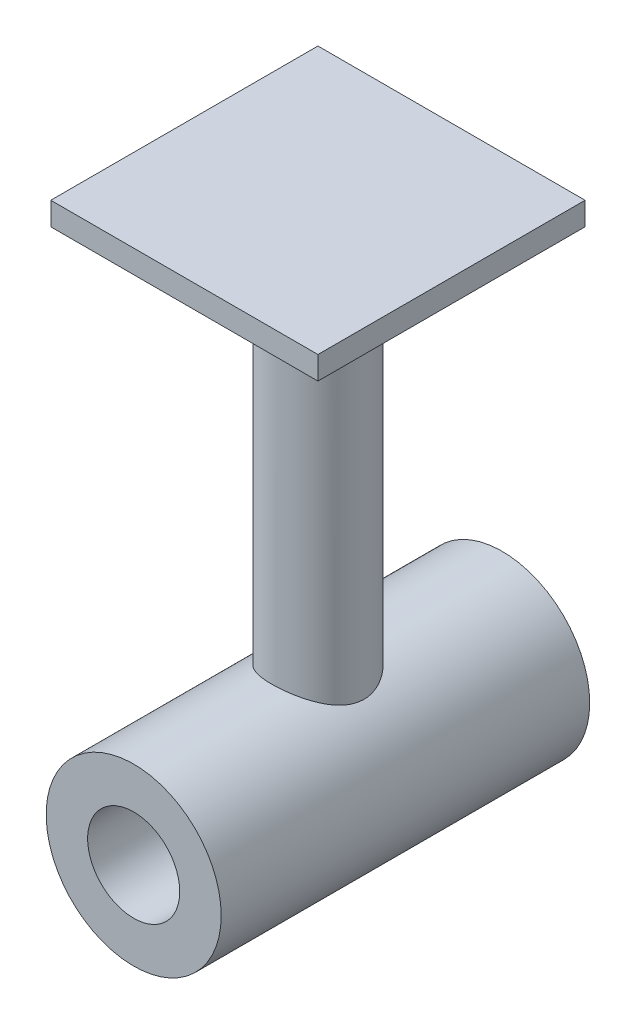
ISO-10303-21;
HEADER;
FILE_DESCRIPTION(('STEP AP214'),'2;1');
FILE_NAME('part.step','',(''),(''),'','','');
FILE_SCHEMA(('AUTOMOTIVE_DESIGN { 1 0 10303 214 1 1 1 1 }'));
ENDSEC;
DATA;
#1=APPLICATION_CONTEXT('core data for automotive mechanical design processes');
#2=APPLICATION_PROTOCOL_DEFINITION('international standard','automotive_design',2000,#1);
#3=PRODUCT_CONTEXT('',#1,'mechanical');
#4=PRODUCT('Part','Part','',(#3));
#5=PRODUCT_RELATED_PRODUCT_CATEGORY('part','',(#4));
#6=PRODUCT_DEFINITION_FORMATION('','',#4);
#7=PRODUCT_DEFINITION_CONTEXT('part definition',#1,'design');
#8=PRODUCT_DEFINITION('design','',#6,#7);
#9=PRODUCT_DEFINITION_SHAPE('','',#8);
#10=(LENGTH_UNIT() NAMED_UNIT(*) SI_UNIT(.MILLI.,.METRE.));
#11=(NAMED_UNIT(*) PLANE_ANGLE_UNIT() SI_UNIT($,.RADIAN.));
#12=(NAMED_UNIT(*) SI_UNIT($,.STERADIAN.) SOLID_ANGLE_UNIT());
#13=UNCERTAINTY_MEASURE_WITH_UNIT(LENGTH_MEASURE(1.E-05),#10,'distance_accuracy_value','');
#14=(GEOMETRIC_REPRESENTATION_CONTEXT(3) GLOBAL_UNCERTAINTY_ASSIGNED_CONTEXT((#13)) GLOBAL_UNIT_ASSIGNED_CONTEXT((#10,
#11,#12)) REPRESENTATION_CONTEXT('',''));
#15=CARTESIAN_POINT('',(0.,0.,0.));
#16=DIRECTION('',(0.,0.,1.));
#17=DIRECTION('',(1.,0.,0.));
#18=AXIS2_PLACEMENT_3D('',#15,#16,#17);
#19=CARTESIAN_POINT('',(0.,0.,40.));
#20=DIRECTION('',(0.,0.,-1.));
#21=DIRECTION('',(-1.,0.,0.));
#22=AXIS2_PLACEMENT_3D('',#19,#20,#21);
#23=CYLINDRICAL_SURFACE('',#22,19.);
#24=CARTESIAN_POINT('',(0.,0.,-40.));
#25=DIRECTION('',(0.,0.,1.));
#26=DIRECTION('',(1.,0.,0.));
#27=AXIS2_PLACEMENT_3D('',#24,#25,#26);
#28=CIRCLE('',#27,19.);
#29=CARTESIAN_POINT('',(19.,0.,-40.));
#30=VERTEX_POINT('',#29);
#31=EDGE_CURVE('E162',#30,#30,#28,.T.);
#32=ORIENTED_EDGE('',*,*,#31,.T.);
#33=EDGE_LOOP('',(#32));
#34=FACE_BOUND('',#33,.T.);
#35=CARTESIAN_POINT('',(0.,0.,40.));
#36=DIRECTION('',(0.,0.,1.));
#37=DIRECTION('',(1.,0.,0.));
#38=AXIS2_PLACEMENT_3D('',#35,#36,#37);
#39=CIRCLE('',#38,19.);
#40=CARTESIAN_POINT('',(19.,0.,40.));
#41=VERTEX_POINT('',#40);
#42=EDGE_CURVE('E165',#41,#41,#39,.T.);
#43=ORIENTED_EDGE('',*,*,#42,.F.);
#44=EDGE_LOOP('',(#43));
#45=FACE_BOUND('',#44,.T.);
#46=CARTESIAN_POINT('',(0.,19.,-10.));
#47=CARTESIAN_POINT('',(-0.261284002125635,19.0000005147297,-10.0000006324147));
#48=CARTESIAN_POINT('',(-0.522560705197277,18.9945987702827,-9.9897489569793));
#49=CARTESIAN_POINT('',(-1.04316816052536,18.9731308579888,-9.94886917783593));
#50=CARTESIAN_POINT('',(-1.30249817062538,18.957060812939,-9.91823366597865));
#51=CARTESIAN_POINT('',(-1.81751271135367,18.9146374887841,-9.8369057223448));
#52=CARTESIAN_POINT('',(-2.07319149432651,18.8882695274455,-9.78618465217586));
#53=CARTESIAN_POINT('',(-2.57867692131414,18.8259203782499,-9.66529653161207));
#54=CARTESIAN_POINT('',(-2.82848403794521,18.7899399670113,-9.59513105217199));
#55=CARTESIAN_POINT('',(-3.31961543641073,18.7094050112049,-9.43644465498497));
#56=CARTESIAN_POINT('',(-3.56096999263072,18.6648858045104,-9.34799927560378));
#57=CARTESIAN_POINT('',(-4.03485602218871,18.5682100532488,-9.15344464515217));
#58=CARTESIAN_POINT('',(-4.26738734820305,18.5160533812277,-9.04733509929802));
#59=CARTESIAN_POINT('',(-4.72235633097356,18.4052752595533,-8.81840050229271));
#60=CARTESIAN_POINT('',(-4.94479706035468,18.3466557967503,-8.69558058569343));
#61=CARTESIAN_POINT('',(-5.37873126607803,18.2241626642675,-8.43406514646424));
#62=CARTESIAN_POINT('',(-5.59022036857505,18.1602869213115,-8.29536335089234));
#63=CARTESIAN_POINT('',(-6.01460634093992,18.024353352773,-7.99353665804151));
#64=CARTESIAN_POINT('',(-6.22670849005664,17.9520335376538,-7.82941208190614));
#65=CARTESIAN_POINT('',(-6.63651342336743,17.804609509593,-7.48520583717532));
#66=CARTESIAN_POINT('',(-6.83421528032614,17.7295051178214,-7.305123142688));
#67=CARTESIAN_POINT('',(-7.21451054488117,17.5781895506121,-6.92980933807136));
#68=CARTESIAN_POINT('',(-7.39709330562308,17.5019776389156,-6.73456773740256));
#69=CARTESIAN_POINT('',(-7.74621354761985,17.3502856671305,-6.32989771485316));
#70=CARTESIAN_POINT('',(-7.91274787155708,17.2748057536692,-6.12046651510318));
#71=CARTESIAN_POINT('',(-8.24291049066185,17.1198877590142,-5.66915875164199));
#72=CARTESIAN_POINT('',(-8.40497498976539,17.0406912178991,-5.42605141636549));
#73=CARTESIAN_POINT('',(-8.70782467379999,16.8879410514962,-4.92537784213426));
#74=CARTESIAN_POINT('',(-8.84861889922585,16.8143850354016,-4.6678178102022));
#75=CARTESIAN_POINT('',(-9.10770883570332,16.6754685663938,-4.13958216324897));
#76=CARTESIAN_POINT('',(-9.22601190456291,16.6101054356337,-3.86891087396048));
#77=CARTESIAN_POINT('',(-9.43882340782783,16.4901048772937,-3.3160680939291));
#78=CARTESIAN_POINT('',(-9.53333475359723,16.4354661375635,-3.03389801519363));
#79=CARTESIAN_POINT('',(-9.69216515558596,16.342273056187,-2.47795243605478));
#80=CARTESIAN_POINT('',(-9.75799252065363,16.3029316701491,-2.20474068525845));
#81=CARTESIAN_POINT('',(-9.86658453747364,16.2374428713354,-1.65219790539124));
#82=CARTESIAN_POINT('',(-9.90935028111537,16.2112948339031,-1.3728671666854));
#83=CARTESIAN_POINT('',(-9.97107137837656,16.1734057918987,-0.810899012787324));
#84=CARTESIAN_POINT('',(-9.9900511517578,16.1616500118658,-0.528265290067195));
#85=CARTESIAN_POINT('',(-10.0039341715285,16.1530610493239,0.0378054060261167));
#86=CARTESIAN_POINT('',(-9.99884019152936,16.1562261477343,0.321242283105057));
#87=CARTESIAN_POINT('',(-9.96701770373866,16.1758715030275,0.847516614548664));
#88=CARTESIAN_POINT('',(-9.94333614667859,16.1904759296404,1.09061653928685));
#89=CARTESIAN_POINT('',(-9.8784085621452,16.230172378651,1.57367261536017));
#90=CARTESIAN_POINT('',(-9.83715681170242,16.2552678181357,1.81362771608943));
#91=CARTESIAN_POINT('',(-9.73759309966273,16.315104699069,2.28870892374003));
#92=CARTESIAN_POINT('',(-9.67928248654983,16.3498453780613,2.52383541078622));
#93=CARTESIAN_POINT('',(-9.54620984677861,16.4278977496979,2.98801042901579));
#94=CARTESIAN_POINT('',(-9.4714412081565,16.4712128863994,3.21705647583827));
#95=CARTESIAN_POINT('',(-9.30431496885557,16.5662050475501,3.67286425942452));
#96=CARTESIAN_POINT('',(-9.21160309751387,16.6180466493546,3.89946183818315));
#97=CARTESIAN_POINT('',(-9.01048616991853,16.7279495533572,4.34404850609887));
#98=CARTESIAN_POINT('',(-8.90207458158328,16.786013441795,4.56203396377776));
#99=CARTESIAN_POINT('',(-8.55432284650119,16.9673731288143,5.20181612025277));
#100=CARTESIAN_POINT('',(-8.29238326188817,17.0978858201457,5.60966156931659));
#101=CARTESIAN_POINT('',(-7.83826688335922,17.3088082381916,6.21592229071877));
#102=CARTESIAN_POINT('',(-7.66424721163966,17.3867412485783,6.42923355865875));
#103=CARTESIAN_POINT('',(-7.2993231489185,17.5430678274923,6.8407160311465));
#104=CARTESIAN_POINT('',(-7.1084231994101,17.6214612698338,7.0388911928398));
#105=CARTESIAN_POINT('',(-6.71045048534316,17.7768258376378,7.41928055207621));
#106=CARTESIAN_POINT('',(-6.5033627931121,17.8537955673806,7.60147968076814));
#107=CARTESIAN_POINT('',(-6.07417007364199,18.0043369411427,7.94862215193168));
#108=CARTESIAN_POINT('',(-5.85207093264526,18.0779098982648,8.11357219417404));
#109=CARTESIAN_POINT('',(-5.38074192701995,18.2239371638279,8.43406097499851));
#110=CARTESIAN_POINT('',(-5.13068725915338,18.2960889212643,8.58852809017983));
#111=CARTESIAN_POINT('',(-4.61627651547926,18.4326014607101,8.87562654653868));
#112=CARTESIAN_POINT('',(-4.35191965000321,18.4969618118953,9.00825668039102));
#113=CARTESIAN_POINT('',(-3.81082956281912,18.6159675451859,9.25015303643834));
#114=CARTESIAN_POINT('',(-3.53410511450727,18.6706196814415,9.35943551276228));
#115=CARTESIAN_POINT('',(-2.97021198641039,18.7685824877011,9.55336065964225));
#116=CARTESIAN_POINT('',(-2.68304466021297,18.811894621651,9.63800651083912));
#117=CARTESIAN_POINT('',(-2.12649785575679,18.882521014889,9.77510765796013));
#118=CARTESIAN_POINT('',(-1.85779198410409,18.9109115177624,9.8297481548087));
#119=CARTESIAN_POINT('',(-1.31585742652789,18.9563295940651,9.91684520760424));
#120=CARTESIAN_POINT('',(-1.04262900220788,18.9733578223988,9.9493030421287));
#121=CARTESIAN_POINT('',(-0.494073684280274,18.9955576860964,9.99157318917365));
#122=CARTESIAN_POINT('',(-0.21874782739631,19.0007348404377,10.0013960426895));
#123=CARTESIAN_POINT('',(0.331732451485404,18.9990971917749,9.9982848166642));
#124=CARTESIAN_POINT('',(0.606886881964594,18.9922830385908,9.9853519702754));
#125=CARTESIAN_POINT('',(1.13052507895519,18.9679853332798,9.93905468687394));
#126=CARTESIAN_POINT('',(1.37922572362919,18.9514930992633,9.90758769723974));
#127=CARTESIAN_POINT('',(1.87276574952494,18.9091005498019,9.82625509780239));
#128=CARTESIAN_POINT('',(2.11760541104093,18.8832009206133,9.77639083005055));
#129=CARTESIAN_POINT('',(2.60184593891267,18.8225914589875,9.65880350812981));
#130=CARTESIAN_POINT('',(2.84124652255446,18.7878811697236,9.59107952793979));
#131=CARTESIAN_POINT('',(3.31316753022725,18.7104279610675,9.43845508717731));
#132=CARTESIAN_POINT('',(3.54568765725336,18.6676846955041,9.35355388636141));
#133=CARTESIAN_POINT('',(4.00844380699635,18.5738933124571,9.16495407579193));
#134=CARTESIAN_POINT('',(4.23846905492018,18.5226606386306,9.06082997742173));
#135=CARTESIAN_POINT('',(4.68883852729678,18.4138142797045,8.83618595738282));
#136=CARTESIAN_POINT('',(4.90917927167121,18.3561983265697,8.71566020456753));
#137=CARTESIAN_POINT('',(5.55406751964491,18.1755666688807,8.3308323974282));
#138=CARTESIAN_POINT('',(5.96273573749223,18.0447135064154,8.04317505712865));
#139=CARTESIAN_POINT('',(6.77145924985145,17.7581098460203,7.37898633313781));
#140=CARTESIAN_POINT('',(7.16603086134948,17.6011898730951,6.99627261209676));
#141=CARTESIAN_POINT('',(7.70723704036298,17.3677103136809,6.37760161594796));
#142=CARTESIAN_POINT('',(7.87931390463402,17.290139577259,6.16375663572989));
#143=CARTESIAN_POINT('',(8.20577824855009,17.1376081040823,5.72194108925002));
#144=CARTESIAN_POINT('',(8.36016292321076,17.0626477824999,5.49396829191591));
#145=CARTESIAN_POINT('',(8.65941013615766,16.9128469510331,5.01005195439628));
#146=CARTESIAN_POINT('',(8.80304472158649,16.8383165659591,4.75325154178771));
#147=CARTESIAN_POINT('',(9.06779974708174,16.6972305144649,4.22633185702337));
#148=CARTESIAN_POINT('',(9.18893102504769,16.6306710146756,3.95621907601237));
#149=CARTESIAN_POINT('',(9.40731953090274,16.508119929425,3.40445109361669));
#150=CARTESIAN_POINT('',(9.50459784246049,16.4521190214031,3.12280634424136));
#151=CARTESIAN_POINT('',(9.67406007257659,16.353049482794,2.54985445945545));
#152=CARTESIAN_POINT('',(9.74624834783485,16.3099786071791,2.2585490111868));
#153=CARTESIAN_POINT('',(9.85856321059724,16.2423087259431,1.69774059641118));
#154=CARTESIAN_POINT('',(9.90113675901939,16.2163141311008,1.42889516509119));
#155=CARTESIAN_POINT('',(9.96424753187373,16.1776128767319,0.887677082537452));
#156=CARTESIAN_POINT('',(9.98478632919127,16.1649052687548,0.615304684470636));
#157=CARTESIAN_POINT('',(10.0034813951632,16.1533427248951,0.0696430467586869));
#158=CARTESIAN_POINT('',(10.0016494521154,16.1544804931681,-0.203645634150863));
#159=CARTESIAN_POINT('',(9.97566176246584,16.1705413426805,-0.748739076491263));
#160=CARTESIAN_POINT('',(9.95150735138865,16.1854635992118,-1.02054392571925));
#161=CARTESIAN_POINT('',(9.88536409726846,16.2259319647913,-1.52887206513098));
#162=CARTESIAN_POINT('',(9.84577155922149,16.2500434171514,-1.76582765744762));
#163=CARTESIAN_POINT('',(9.74992729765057,16.3077296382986,-2.23524548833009));
#164=CARTESIAN_POINT('',(9.6936701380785,16.3413074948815,-2.46770623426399));
#165=CARTESIAN_POINT('',(9.56510209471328,16.4168928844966,-2.92670680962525));
#166=CARTESIAN_POINT('',(9.49279294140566,16.4588995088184,-3.1532472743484));
#167=CARTESIAN_POINT('',(9.33278131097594,16.5501561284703,-3.59936363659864));
#168=CARTESIAN_POINT('',(9.24507274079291,16.5994089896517,-3.81893673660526));
#169=CARTESIAN_POINT('',(8.94751945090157,16.7629148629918,-4.49371460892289));
#170=CARTESIAN_POINT('',(8.71156310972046,16.8877835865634,-4.93512841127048));
#171=CARTESIAN_POINT('',(8.17907054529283,17.1519945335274,-5.77498340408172));
#172=CARTESIAN_POINT('',(7.88250172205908,17.2913445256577,-6.17340129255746));
#173=CARTESIAN_POINT('',(7.37386606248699,17.5119034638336,-6.7606006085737));
#174=CARTESIAN_POINT('',(7.18023518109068,17.5923703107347,-6.96590795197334));
#175=CARTESIAN_POINT('',(6.77605932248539,17.7519622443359,-7.3596581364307));
#176=CARTESIAN_POINT('',(6.5655194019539,17.8310877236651,-7.54810598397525));
#177=CARTESIAN_POINT('',(6.12833263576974,17.9860327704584,-7.907188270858));
#178=CARTESIAN_POINT('',(5.90167343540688,18.0618497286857,-8.07780879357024));
#179=CARTESIAN_POINT('',(5.43345572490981,18.2081771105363,-8.39989878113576));
#180=CARTESIAN_POINT('',(5.19189554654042,18.2786869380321,-8.55136609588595));
#181=CARTESIAN_POINT('',(4.69007445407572,18.4139103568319,-8.83675349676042));
#182=CARTESIAN_POINT('',(4.42953125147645,18.4784750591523,-8.97024902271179));
#183=CARTESIAN_POINT('',(3.89606361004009,18.5982625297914,-9.21448276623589));
#184=CARTESIAN_POINT('',(3.62314535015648,18.6534898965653,-9.3252321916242));
#185=CARTESIAN_POINT('',(3.06737047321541,18.7528865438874,-9.52249972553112));
#186=CARTESIAN_POINT('',(2.78453560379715,18.7970784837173,-9.60906753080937));
#187=CARTESIAN_POINT('',(2.21088063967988,18.8731460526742,-9.75703214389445));
#188=CARTESIAN_POINT('',(1.92006517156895,18.9050286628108,-9.81844322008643));
#189=CARTESIAN_POINT('',(1.3585010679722,18.9532815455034,-9.91101868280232));
#190=CARTESIAN_POINT('',(1.08820229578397,18.9707582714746,-9.9443461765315));
#191=CARTESIAN_POINT('',(0.545266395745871,18.9941173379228,-9.98883671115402));
#192=CARTESIAN_POINT('',(0.272629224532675,18.9999994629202,-9.99999934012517));
#193=CARTESIAN_POINT('',(0.,19.,-10.));
#194=B_SPLINE_CURVE_WITH_KNOTS('',3,(#46,#47,#48,#49,#50,#51,#52,#53,#54,#55,#56,#57,#58,#59,
#60,#61,#62,#63,#64,#65,#66,#67,#68,#69,#70,#71,#72,#73,#74,#75,#76,#77,#78,#79,#80,#81,#82,#83,
#84,#85,#86,#87,#88,#89,#90,#91,#92,#93,#94,#95,#96,#97,#98,#99,#100,#101,#102,#103,#104,#105,
#106,#107,#108,#109,#110,#111,#112,#113,#114,#115,#116,#117,#118,#119,#120,#121,#122,#123,#124,
#125,#126,#127,#128,#129,#130,#131,#132,#133,#134,#135,#136,#137,#138,#139,#140,#141,#142,#143,
#144,#145,#146,#147,#148,#149,#150,#151,#152,#153,#154,#155,#156,#157,#158,#159,#160,#161,#162,
#163,#164,#165,#166,#167,#168,#169,#170,#171,#172,#173,#174,#175,#176,#177,#178,#179,#180,#181,
#182,#183,#184,#185,#186,#187,#188,#189,#190,#191,#192,#193),.UNSPECIFIED.,.T.,.F.,(4,2,2,2,2,2,
2,2,2,2,2,2,2,2,2,2,2,2,2,2,2,2,2,2,2,2,2,2,2,2,2,2,2,2,2,2,2,2,2,2,2,2,2,2,2,2,2,2,2,2,2,2,2,2,
2,2,2,2,2,2,2,2,2,2,2,2,2,2,2,2,2,2,2,4),(0.,0.783584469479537,1.56745387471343,
2.35244498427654,3.13737269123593,3.91911945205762,4.70087926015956,5.48239939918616,
6.26422929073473,7.09665835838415,7.92914097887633,8.7622049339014,9.59543245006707,
10.5024590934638,11.4090991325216,12.3154420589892,13.221674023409,14.071734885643,
14.9217554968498,15.7709027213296,16.6199521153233,17.3531458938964,18.0865786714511,
18.8199534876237,19.553623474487,20.3036140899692,21.0539176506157,22.5538035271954,
23.4114231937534,24.2688178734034,25.1270127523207,25.9848730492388,26.8916087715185,
27.7983946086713,28.7045470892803,29.6105825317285,30.4364704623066,31.2623107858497,
32.087766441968,32.9131773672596,33.6659770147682,34.4187217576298,35.1715055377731,
35.9243217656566,36.6964057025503,37.4687648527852,39.0126504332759,40.7198458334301,
41.5748048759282,42.4298992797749,43.3393150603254,44.2482917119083,45.1564619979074,
46.0644745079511,46.8835924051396,47.7026518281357,48.5212796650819,49.3398585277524,
50.0633953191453,50.7871683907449,51.5108634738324,52.2348455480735,53.7760426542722,
55.318070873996,56.197603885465,57.0768748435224,57.9568271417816,58.836878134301,
59.7350141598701,60.6327065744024,61.5285402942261,62.4238652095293,63.2414585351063,
64.0590670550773),.UNSPECIFIED.);
#195=CARTESIAN_POINT('',(0.,19.,-10.));
#196=VERTEX_POINT('',#195);
#197=EDGE_CURVE('E11',#196,#196,#194,.T.);
#198=ORIENTED_EDGE('',*,*,#197,.F.);
#199=EDGE_LOOP('',(#198));
#200=FACE_BOUND('',#199,.T.);
#201=ADVANCED_FACE('F32',(#34,#45,#200),#23,.T.);
#202=CARTESIAN_POINT('',(0.,0.,40.));
#203=DIRECTION('',(0.,0.,-1.));
#204=DIRECTION('',(-1.,0.,0.));
#205=AXIS2_PLACEMENT_3D('',#202,#203,#204);
#206=CYLINDRICAL_SURFACE('',#205,10.);
#207=CARTESIAN_POINT('',(0.,0.,-40.));
#208=DIRECTION('',(0.,0.,1.));
#209=DIRECTION('',(1.,0.,0.));
#210=AXIS2_PLACEMENT_3D('',#207,#208,#209);
#211=CIRCLE('',#210,10.);
#212=CARTESIAN_POINT('',(10.,0.,-40.));
#213=VERTEX_POINT('',#212);
#214=EDGE_CURVE('E126',#213,#213,#211,.T.);
#215=ORIENTED_EDGE('',*,*,#214,.F.);
#216=EDGE_LOOP('',(#215));
#217=FACE_BOUND('',#216,.T.);
#218=CARTESIAN_POINT('',(0.,0.,40.));
#219=DIRECTION('',(0.,0.,1.));
#220=DIRECTION('',(1.,0.,0.));
#221=AXIS2_PLACEMENT_3D('',#218,#219,#220);
#222=CIRCLE('',#221,10.);
#223=CARTESIAN_POINT('',(10.,0.,40.));
#224=VERTEX_POINT('',#223);
#225=EDGE_CURVE('E183',#224,#224,#222,.T.);
#226=ORIENTED_EDGE('',*,*,#225,.T.);
#227=EDGE_LOOP('',(#226));
#228=FACE_BOUND('',#227,.T.);
#229=CARTESIAN_POINT('',(0.,0.,0.));
#230=DIRECTION('',(0.,0.707106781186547,-0.707106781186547));
#231=DIRECTION('',(0.,-0.707106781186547,-0.707106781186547));
#232=AXIS2_PLACEMENT_3D('',#229,#230,#231);
#233=ELLIPSE('',#232,14.1421356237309,10.);
#234=CARTESIAN_POINT('',(-10.,0.,0.));
#235=VERTEX_POINT('',#234);
#236=CARTESIAN_POINT('',(10.,0.,0.));
#237=VERTEX_POINT('',#236);
#238=EDGE_CURVE('E53',#235,#237,#233,.T.);
#239=ORIENTED_EDGE('',*,*,#238,.T.);
#240=CARTESIAN_POINT('',(0.,0.,0.));
#241=DIRECTION('',(0.,-0.707106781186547,-0.707106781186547));
#242=DIRECTION('',(0.,0.707106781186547,-0.707106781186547));
#243=AXIS2_PLACEMENT_3D('',#240,#241,#242);
#244=ELLIPSE('',#243,14.1421356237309,10.);
#245=EDGE_CURVE('E36',#237,#235,#244,.F.);
#246=ORIENTED_EDGE('',*,*,#245,.T.);
#247=EDGE_LOOP('',(#239,#246));
#248=FACE_BOUND('',#247,.T.);
#249=ADVANCED_FACE('F146',(#217,#228,#248),#206,.F.);
#250=CARTESIAN_POINT('',(0.,0.,40.));
#251=DIRECTION('',(0.,0.,1.));
#252=DIRECTION('',(1.,0.,0.));
#253=AXIS2_PLACEMENT_3D('',#250,#251,#252);
#254=PLANE('',#253);
#255=ORIENTED_EDGE('',*,*,#42,.T.);
#256=EDGE_LOOP('',(#255));
#257=FACE_BOUND('',#256,.T.);
#258=ORIENTED_EDGE('',*,*,#225,.F.);
#259=EDGE_LOOP('',(#258));
#260=FACE_BOUND('',#259,.T.);
#261=ADVANCED_FACE('F144',(#257,#260),#254,.T.);
#262=CARTESIAN_POINT('',(0.,0.,-40.));
#263=DIRECTION('',(0.,0.,1.));
#264=DIRECTION('',(1.,0.,0.));
#265=AXIS2_PLACEMENT_3D('',#262,#263,#264);
#266=PLANE('',#265);
#267=ORIENTED_EDGE('',*,*,#214,.T.);
#268=EDGE_LOOP('',(#267));
#269=FACE_BOUND('',#268,.T.);
#270=ORIENTED_EDGE('',*,*,#31,.F.);
#271=EDGE_LOOP('',(#270));
#272=FACE_BOUND('',#271,.T.);
#273=ADVANCED_FACE('F141',(#269,#272),#266,.F.);
#274=CARTESIAN_POINT('',(0.,100.,0.));
#275=DIRECTION('',(0.,-1.,0.));
#276=DIRECTION('',(0.,0.,-1.));
#277=AXIS2_PLACEMENT_3D('',#274,#275,#276);
#278=CYLINDRICAL_SURFACE('',#277,10.);
#279=ORIENTED_EDGE('',*,*,#245,.F.);
#280=CARTESIAN_POINT('',(0.,0.,0.));
#281=DIRECTION('',(0.,1.,0.));
#282=DIRECTION('',(0.,0.,1.));
#283=AXIS2_PLACEMENT_3D('',#280,#281,#282);
#284=CIRCLE('',#283,10.);
#285=EDGE_CURVE('E47',#237,#235,#284,.T.);
#286=ORIENTED_EDGE('',*,*,#285,.T.);
#287=EDGE_LOOP('',(#279,#286));
#288=FACE_BOUND('',#287,.T.);
#289=ADVANCED_FACE('F139',(#288),#278,.T.);
#290=CARTESIAN_POINT('',(0.,0.,0.));
#291=DIRECTION('',(0.,1.,0.));
#292=DIRECTION('',(0.,0.,1.));
#293=AXIS2_PLACEMENT_3D('',#290,#291,#292);
#294=PLANE('',#293);
#295=ORIENTED_EDGE('',*,*,#285,.F.);
#296=EDGE_CURVE('E99',#235,#237,#284,.T.);
#297=ORIENTED_EDGE('',*,*,#296,.F.);
#298=EDGE_LOOP('',(#295,#297));
#299=FACE_BOUND('',#298,.T.);
#300=ADVANCED_FACE('F138',(#299),#294,.F.);
#301=ORIENTED_EDGE('',*,*,#238,.F.);
#302=ORIENTED_EDGE('',*,*,#296,.T.);
#303=EDGE_LOOP('',(#301,#302));
#304=FACE_BOUND('',#303,.T.);
#305=ADVANCED_FACE('F132',(#304),#278,.T.);
#306=CARTESIAN_POINT('',(0.,100.,0.));
#307=DIRECTION('',(0.,1.,0.));
#308=DIRECTION('',(0.,0.,1.));
#309=AXIS2_PLACEMENT_3D('',#306,#307,#308);
#310=CIRCLE('',#309,10.);
#311=CARTESIAN_POINT('',(0.,100.,10.));
#312=VERTEX_POINT('',#311);
#313=EDGE_CURVE('E124',#312,#312,#310,.T.);
#314=ORIENTED_EDGE('',*,*,#313,.F.);
#315=EDGE_LOOP('',(#314));
#316=FACE_BOUND('',#315,.T.);
#317=ORIENTED_EDGE('',*,*,#197,.T.);
#318=EDGE_LOOP('',(#317));
#319=FACE_BOUND('',#318,.T.);
#320=ADVANCED_FACE('F137',(#316,#319),#278,.T.);
#321=CARTESIAN_POINT('',(29.,100.,29.));
#322=DIRECTION('',(0.,-1.,0.));
#323=DIRECTION('',(0.,0.,-1.));
#324=AXIS2_PLACEMENT_3D('',#321,#322,#323);
#325=PLANE('',#324);
#326=DIRECTION('',(0.,0.,-1.));
#327=VECTOR('',#326,1.);
#328=CARTESIAN_POINT('',(29.,100.,-29.));
#329=LINE('',#328,#327);
#330=CARTESIAN_POINT('',(29.,100.,29.));
#331=VERTEX_POINT('',#330);
#332=CARTESIAN_POINT('',(29.,100.,-29.));
#333=VERTEX_POINT('',#332);
#334=EDGE_CURVE('E86',#331,#333,#329,.T.);
#335=ORIENTED_EDGE('',*,*,#334,.F.);
#336=DIRECTION('',(1.,0.,0.));
#337=VECTOR('',#336,1.);
#338=CARTESIAN_POINT('',(29.,100.,29.));
#339=LINE('',#338,#337);
#340=CARTESIAN_POINT('',(-29.,100.,29.));
#341=VERTEX_POINT('',#340);
#342=EDGE_CURVE('E109',#341,#331,#339,.T.);
#343=ORIENTED_EDGE('',*,*,#342,.F.);
#344=DIRECTION('',(0.,0.,1.));
#345=VECTOR('',#344,1.);
#346=CARTESIAN_POINT('',(-29.,100.,-29.));
#347=LINE('',#346,#345);
#348=CARTESIAN_POINT('',(-29.,100.,-29.));
#349=VERTEX_POINT('',#348);
#350=EDGE_CURVE('E87',#349,#341,#347,.T.);
#351=ORIENTED_EDGE('',*,*,#350,.F.);
#352=DIRECTION('',(-1.,0.,0.));
#353=VECTOR('',#352,1.);
#354=CARTESIAN_POINT('',(29.,100.,-29.));
#355=LINE('',#354,#353);
#356=EDGE_CURVE('E80',#333,#349,#355,.T.);
#357=ORIENTED_EDGE('',*,*,#356,.F.);
#358=EDGE_LOOP('',(#335,#343,#351,#357));
#359=FACE_BOUND('',#358,.T.);
#360=ORIENTED_EDGE('',*,*,#313,.T.);
#361=EDGE_LOOP('',(#360));
#362=FACE_BOUND('',#361,.T.);
#363=ADVANCED_FACE('F82',(#359,#362),#325,.T.);
#364=CARTESIAN_POINT('',(29.,105.,-29.));
#365=DIRECTION('',(-1.,0.,0.));
#366=DIRECTION('',(0.,0.,1.));
#367=AXIS2_PLACEMENT_3D('',#364,#365,#366);
#368=PLANE('',#367);
#369=ORIENTED_EDGE('',*,*,#334,.T.);
#370=DIRECTION('',(0.,-1.,0.));
#371=VECTOR('',#370,1.);
#372=CARTESIAN_POINT('',(29.,105.,-29.));
#373=LINE('',#372,#371);
#374=CARTESIAN_POINT('',(29.,105.,-29.));
#375=VERTEX_POINT('',#374);
#376=EDGE_CURVE('E93',#375,#333,#373,.T.);
#377=ORIENTED_EDGE('',*,*,#376,.F.);
#378=DIRECTION('',(0.,0.,-1.));
#379=VECTOR('',#378,1.);
#380=CARTESIAN_POINT('',(29.,105.,-29.));
#381=LINE('',#380,#379);
#382=CARTESIAN_POINT('',(29.,105.,29.));
#383=VERTEX_POINT('',#382);
#384=EDGE_CURVE('E111',#383,#375,#381,.T.);
#385=ORIENTED_EDGE('',*,*,#384,.F.);
#386=DIRECTION('',(0.,-1.,0.));
#387=VECTOR('',#386,1.);
#388=CARTESIAN_POINT('',(29.,105.,29.));
#389=LINE('',#388,#387);
#390=EDGE_CURVE('E105',#383,#331,#389,.T.);
#391=ORIENTED_EDGE('',*,*,#390,.T.);
#392=EDGE_LOOP('',(#369,#377,#385,#391));
#393=FACE_BOUND('',#392,.T.);
#394=ADVANCED_FACE('F103',(#393),#368,.F.);
#395=CARTESIAN_POINT('',(29.,105.,-29.));
#396=DIRECTION('',(0.,0.,1.));
#397=DIRECTION('',(1.,0.,0.));
#398=AXIS2_PLACEMENT_3D('',#395,#396,#397);
#399=PLANE('',#398);
#400=ORIENTED_EDGE('',*,*,#356,.T.);
#401=DIRECTION('',(0.,-1.,0.));
#402=VECTOR('',#401,1.);
#403=CARTESIAN_POINT('',(-29.,105.,-29.));
#404=LINE('',#403,#402);
#405=CARTESIAN_POINT('',(-29.,105.,-29.));
#406=VERTEX_POINT('',#405);
#407=EDGE_CURVE('E100',#406,#349,#404,.T.);
#408=ORIENTED_EDGE('',*,*,#407,.F.);
#409=DIRECTION('',(-1.,0.,0.));
#410=VECTOR('',#409,1.);
#411=CARTESIAN_POINT('',(29.,105.,-29.));
#412=LINE('',#411,#410);
#413=EDGE_CURVE('E95',#375,#406,#412,.T.);
#414=ORIENTED_EDGE('',*,*,#413,.F.);
#415=ORIENTED_EDGE('',*,*,#376,.T.);
#416=EDGE_LOOP('',(#400,#408,#414,#415));
#417=FACE_BOUND('',#416,.T.);
#418=ADVANCED_FACE('F94',(#417),#399,.F.);
#419=CARTESIAN_POINT('',(-29.,105.,-29.));
#420=DIRECTION('',(1.,0.,0.));
#421=DIRECTION('',(0.,0.,-1.));
#422=AXIS2_PLACEMENT_3D('',#419,#420,#421);
#423=PLANE('',#422);
#424=ORIENTED_EDGE('',*,*,#350,.T.);
#425=DIRECTION('',(0.,-1.,0.));
#426=VECTOR('',#425,1.);
#427=CARTESIAN_POINT('',(-29.,105.,29.));
#428=LINE('',#427,#426);
#429=CARTESIAN_POINT('',(-29.,105.,29.));
#430=VERTEX_POINT('',#429);
#431=EDGE_CURVE('E119',#430,#341,#428,.T.);
#432=ORIENTED_EDGE('',*,*,#431,.F.);
#433=DIRECTION('',(0.,0.,1.));
#434=VECTOR('',#433,1.);
#435=CARTESIAN_POINT('',(-29.,105.,-29.));
#436=LINE('',#435,#434);
#437=EDGE_CURVE('E114',#406,#430,#436,.T.);
#438=ORIENTED_EDGE('',*,*,#437,.F.);
#439=ORIENTED_EDGE('',*,*,#407,.T.);
#440=EDGE_LOOP('',(#424,#432,#438,#439));
#441=FACE_BOUND('',#440,.T.);
#442=ADVANCED_FACE('F224',(#441),#423,.F.);
#443=CARTESIAN_POINT('',(29.,105.,29.));
#444=DIRECTION('',(0.,0.,-1.));
#445=DIRECTION('',(-1.,0.,0.));
#446=AXIS2_PLACEMENT_3D('',#443,#444,#445);
#447=PLANE('',#446);
#448=ORIENTED_EDGE('',*,*,#342,.T.);
#449=ORIENTED_EDGE('',*,*,#390,.F.);
#450=DIRECTION('',(1.,0.,0.));
#451=VECTOR('',#450,1.);
#452=CARTESIAN_POINT('',(29.,105.,29.));
#453=LINE('',#452,#451);
#454=EDGE_CURVE('E116',#430,#383,#453,.T.);
#455=ORIENTED_EDGE('',*,*,#454,.F.);
#456=ORIENTED_EDGE('',*,*,#431,.T.);
#457=EDGE_LOOP('',(#448,#449,#455,#456));
#458=FACE_BOUND('',#457,.T.);
#459=ADVANCED_FACE('F233',(#458),#447,.F.);
#460=CARTESIAN_POINT('',(29.,105.,29.));
#461=DIRECTION('',(0.,-1.,0.));
#462=DIRECTION('',(0.,0.,-1.));
#463=AXIS2_PLACEMENT_3D('',#460,#461,#462);
#464=PLANE('',#463);
#465=ORIENTED_EDGE('',*,*,#384,.T.);
#466=ORIENTED_EDGE('',*,*,#413,.T.);
#467=ORIENTED_EDGE('',*,*,#437,.T.);
#468=ORIENTED_EDGE('',*,*,#454,.T.);
#469=EDGE_LOOP('',(#465,#466,#467,#468));
#470=FACE_BOUND('',#469,.T.);
#471=ADVANCED_FACE('F243',(#470),#464,.F.);
#472=CLOSED_SHELL('',(#201,#249,#261,#273,#289,#300,#305,#320,#363,#394,#418,#442,#459,#471));
#473=MANIFOLD_SOLID_BREP('B2',#472);
#474=ADVANCED_BREP_SHAPE_REPRESENTATION('',(#18,#473),#14);
#475=SHAPE_DEFINITION_REPRESENTATION(#9,#474);
ENDSEC;
END-ISO-10303-21;
